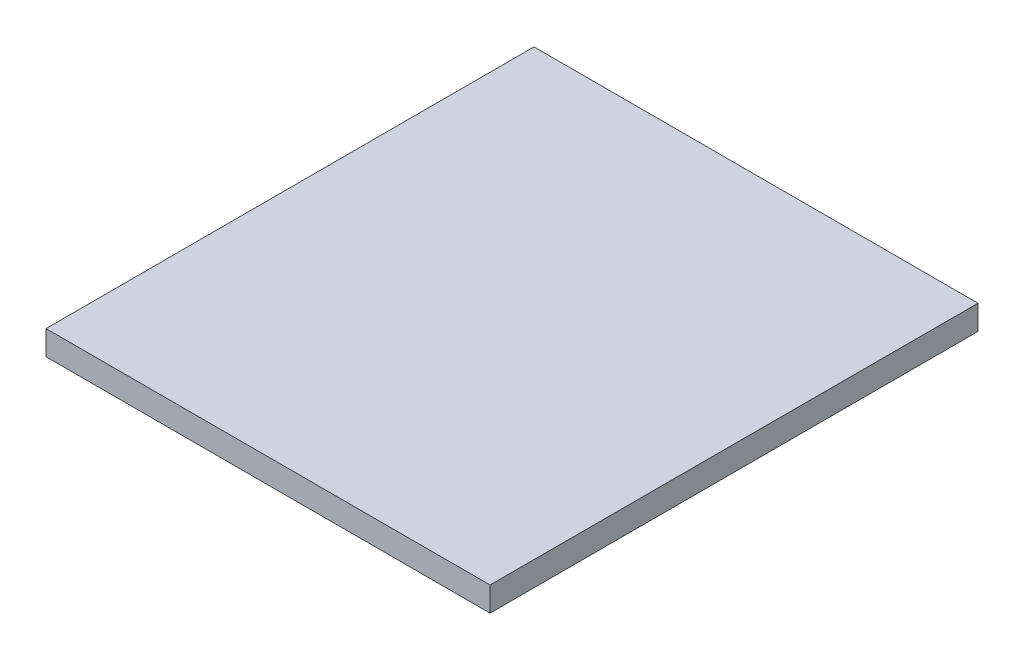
ISO-10303-21;
HEADER;
FILE_DESCRIPTION(('STEP AP214'),'2;1');
FILE_NAME('part.step','',(''),(''),'','','');
FILE_SCHEMA(('AUTOMOTIVE_DESIGN { 1 0 10303 214 1 1 1 1 }'));
ENDSEC;
DATA;
#1=APPLICATION_CONTEXT('core data for automotive mechanical design processes');
#2=APPLICATION_PROTOCOL_DEFINITION('international standard','automotive_design',2000,#1);
#3=PRODUCT_CONTEXT('',#1,'mechanical');
#4=PRODUCT('Part','Part','',(#3));
#5=PRODUCT_RELATED_PRODUCT_CATEGORY('part','',(#4));
#6=PRODUCT_DEFINITION_FORMATION('','',#4);
#7=PRODUCT_DEFINITION_CONTEXT('part definition',#1,'design');
#8=PRODUCT_DEFINITION('design','',#6,#7);
#9=PRODUCT_DEFINITION_SHAPE('','',#8);
#10=(LENGTH_UNIT() NAMED_UNIT(*) SI_UNIT(.MILLI.,.METRE.));
#11=(NAMED_UNIT(*) PLANE_ANGLE_UNIT() SI_UNIT($,.RADIAN.));
#12=(NAMED_UNIT(*) SI_UNIT($,.STERADIAN.) SOLID_ANGLE_UNIT());
#13=UNCERTAINTY_MEASURE_WITH_UNIT(LENGTH_MEASURE(1.E-05),#10,'distance_accuracy_value','');
#14=(GEOMETRIC_REPRESENTATION_CONTEXT(3) GLOBAL_UNCERTAINTY_ASSIGNED_CONTEXT((#13)) GLOBAL_UNIT_ASSIGNED_CONTEXT((#10,
#11,#12)) REPRESENTATION_CONTEXT('',''));
#15=CARTESIAN_POINT('',(0.,0.,0.));
#16=DIRECTION('',(0.,0.,1.));
#17=DIRECTION('',(1.,0.,0.));
#18=AXIS2_PLACEMENT_3D('',#15,#16,#17);
#19=CARTESIAN_POINT('',(-45.5,5.,100.));
#20=DIRECTION('',(1.,0.,0.));
#21=DIRECTION('',(0.,0.,-1.));
#22=AXIS2_PLACEMENT_3D('',#19,#20,#21);
#23=PLANE('',#22);
#24=DIRECTION('',(0.,-1.,0.));
#25=VECTOR('',#24,1.);
#26=CARTESIAN_POINT('',(-45.5,5.,0.));
#27=LINE('',#26,#25);
#28=CARTESIAN_POINT('',(-45.5,5.,0.));
#29=VERTEX_POINT('',#28);
#30=CARTESIAN_POINT('',(-45.5,0.,0.));
#31=VERTEX_POINT('',#30);
#32=EDGE_CURVE('E77',#29,#31,#27,.T.);
#33=ORIENTED_EDGE('',*,*,#32,.T.);
#34=DIRECTION('',(0.,0.,-1.));
#35=VECTOR('',#34,1.);
#36=CARTESIAN_POINT('',(-45.5,0.,100.));
#37=LINE('',#36,#35);
#38=CARTESIAN_POINT('',(-45.5,0.,100.));
#39=VERTEX_POINT('',#38);
#40=EDGE_CURVE('E11',#39,#31,#37,.T.);
#41=ORIENTED_EDGE('',*,*,#40,.F.);
#42=DIRECTION('',(0.,-1.,0.));
#43=VECTOR('',#42,1.);
#44=CARTESIAN_POINT('',(-45.5,5.,100.));
#45=LINE('',#44,#43);
#46=CARTESIAN_POINT('',(-45.5,5.,100.));
#47=VERTEX_POINT('',#46);
#48=EDGE_CURVE('E95',#47,#39,#45,.T.);
#49=ORIENTED_EDGE('',*,*,#48,.F.);
#50=DIRECTION('',(0.,0.,-1.));
#51=VECTOR('',#50,1.);
#52=CARTESIAN_POINT('',(-45.5,5.,100.));
#53=LINE('',#52,#51);
#54=EDGE_CURVE('E89',#47,#29,#53,.T.);
#55=ORIENTED_EDGE('',*,*,#54,.T.);
#56=EDGE_LOOP('',(#33,#41,#49,#55));
#57=FACE_BOUND('',#56,.T.);
#58=ADVANCED_FACE('F33',(#57),#23,.F.);
#59=CARTESIAN_POINT('',(-45.5,0.,100.));
#60=DIRECTION('',(0.,1.,0.));
#61=DIRECTION('',(0.,0.,1.));
#62=AXIS2_PLACEMENT_3D('',#59,#60,#61);
#63=PLANE('',#62);
#64=DIRECTION('',(1.,0.,0.));
#65=VECTOR('',#64,1.);
#66=CARTESIAN_POINT('',(-45.5,0.,0.));
#67=LINE('',#66,#65);
#68=CARTESIAN_POINT('',(45.5,0.,0.));
#69=VERTEX_POINT('',#68);
#70=EDGE_CURVE('E73',#31,#69,#67,.T.);
#71=ORIENTED_EDGE('',*,*,#70,.T.);
#72=DIRECTION('',(0.,0.,-1.));
#73=VECTOR('',#72,1.);
#74=CARTESIAN_POINT('',(45.5,0.,100.));
#75=LINE('',#74,#73);
#76=CARTESIAN_POINT('',(45.5,0.,100.));
#77=VERTEX_POINT('',#76);
#78=EDGE_CURVE('E40',#77,#69,#75,.T.);
#79=ORIENTED_EDGE('',*,*,#78,.F.);
#80=DIRECTION('',(1.,0.,0.));
#81=VECTOR('',#80,1.);
#82=CARTESIAN_POINT('',(-45.5,0.,100.));
#83=LINE('',#82,#81);
#84=EDGE_CURVE('E85',#39,#77,#83,.T.);
#85=ORIENTED_EDGE('',*,*,#84,.F.);
#86=ORIENTED_EDGE('',*,*,#40,.T.);
#87=EDGE_LOOP('',(#71,#79,#85,#86));
#88=FACE_BOUND('',#87,.T.);
#89=ADVANCED_FACE('F84',(#88),#63,.F.);
#90=CARTESIAN_POINT('',(45.5,5.,100.));
#91=DIRECTION('',(-1.,0.,0.));
#92=DIRECTION('',(0.,0.,1.));
#93=AXIS2_PLACEMENT_3D('',#90,#91,#92);
#94=PLANE('',#93);
#95=DIRECTION('',(0.,1.,0.));
#96=VECTOR('',#95,1.);
#97=CARTESIAN_POINT('',(45.5,5.,0.));
#98=LINE('',#97,#96);
#99=CARTESIAN_POINT('',(45.5,5.,0.));
#100=VERTEX_POINT('',#99);
#101=EDGE_CURVE('E78',#69,#100,#98,.T.);
#102=ORIENTED_EDGE('',*,*,#101,.T.);
#103=DIRECTION('',(0.,0.,-1.));
#104=VECTOR('',#103,1.);
#105=CARTESIAN_POINT('',(45.5,5.,100.));
#106=LINE('',#105,#104);
#107=CARTESIAN_POINT('',(45.5,5.,100.));
#108=VERTEX_POINT('',#107);
#109=EDGE_CURVE('E101',#108,#100,#106,.T.);
#110=ORIENTED_EDGE('',*,*,#109,.F.);
#111=DIRECTION('',(0.,1.,0.));
#112=VECTOR('',#111,1.);
#113=CARTESIAN_POINT('',(45.5,5.,100.));
#114=LINE('',#113,#112);
#115=EDGE_CURVE('E52',#77,#108,#114,.T.);
#116=ORIENTED_EDGE('',*,*,#115,.F.);
#117=ORIENTED_EDGE('',*,*,#78,.T.);
#118=EDGE_LOOP('',(#102,#110,#116,#117));
#119=FACE_BOUND('',#118,.T.);
#120=ADVANCED_FACE('F104',(#119),#94,.F.);
#121=CARTESIAN_POINT('',(-45.5,5.,100.));
#122=DIRECTION('',(0.,-1.,0.));
#123=DIRECTION('',(0.,0.,-1.));
#124=AXIS2_PLACEMENT_3D('',#121,#122,#123);
#125=PLANE('',#124);
#126=DIRECTION('',(-1.,0.,0.));
#127=VECTOR('',#126,1.);
#128=CARTESIAN_POINT('',(-45.5,5.,0.));
#129=LINE('',#128,#127);
#130=EDGE_CURVE('E93',#100,#29,#129,.T.);
#131=ORIENTED_EDGE('',*,*,#130,.T.);
#132=ORIENTED_EDGE('',*,*,#54,.F.);
#133=DIRECTION('',(-1.,0.,0.));
#134=VECTOR('',#133,1.);
#135=CARTESIAN_POINT('',(-45.5,5.,100.));
#136=LINE('',#135,#134);
#137=EDGE_CURVE('E47',#108,#47,#136,.T.);
#138=ORIENTED_EDGE('',*,*,#137,.F.);
#139=ORIENTED_EDGE('',*,*,#109,.T.);
#140=EDGE_LOOP('',(#131,#132,#138,#139));
#141=FACE_BOUND('',#140,.T.);
#142=ADVANCED_FACE('F106',(#141),#125,.F.);
#143=CARTESIAN_POINT('',(-45.5,0.,100.));
#144=DIRECTION('',(0.,0.,1.));
#145=DIRECTION('',(1.,0.,0.));
#146=AXIS2_PLACEMENT_3D('',#143,#144,#145);
#147=PLANE('',#146);
#148=ORIENTED_EDGE('',*,*,#48,.T.);
#149=ORIENTED_EDGE('',*,*,#84,.T.);
#150=ORIENTED_EDGE('',*,*,#115,.T.);
#151=ORIENTED_EDGE('',*,*,#137,.T.);
#152=EDGE_LOOP('',(#148,#149,#150,#151));
#153=FACE_BOUND('',#152,.T.);
#154=ADVANCED_FACE('F107',(#153),#147,.T.);
#155=CARTESIAN_POINT('',(-45.5,0.,0.));
#156=DIRECTION('',(0.,0.,1.));
#157=DIRECTION('',(1.,0.,0.));
#158=AXIS2_PLACEMENT_3D('',#155,#156,#157);
#159=PLANE('',#158);
#160=ORIENTED_EDGE('',*,*,#32,.F.);
#161=ORIENTED_EDGE('',*,*,#130,.F.);
#162=ORIENTED_EDGE('',*,*,#101,.F.);
#163=ORIENTED_EDGE('',*,*,#70,.F.);
#164=EDGE_LOOP('',(#160,#161,#162,#163));
#165=FACE_BOUND('',#164,.T.);
#166=ADVANCED_FACE('F74',(#165),#159,.F.);
#167=CLOSED_SHELL('',(#58,#89,#120,#142,#154,#166));
#168=MANIFOLD_SOLID_BREP('B2',#167);
#169=ADVANCED_BREP_SHAPE_REPRESENTATION('',(#18,#168),#14);
#170=SHAPE_DEFINITION_REPRESENTATION(#9,#169);
ENDSEC;
END-ISO-10303-21;
